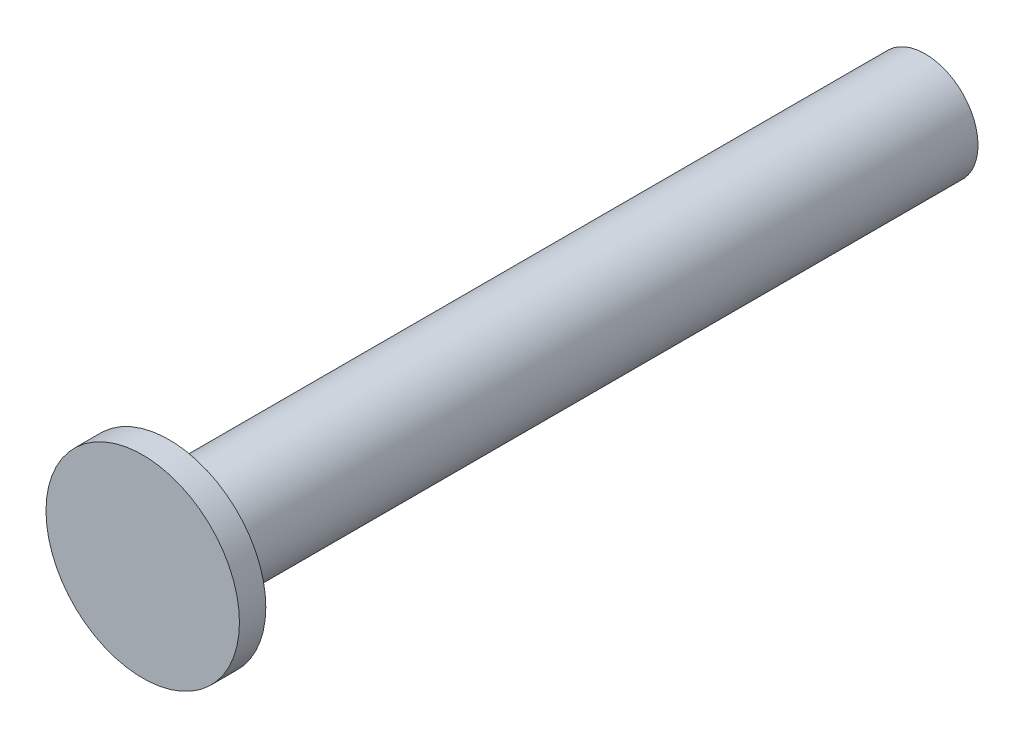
ISO-10303-21;
HEADER;
FILE_DESCRIPTION(('STEP AP214'),'2;1');
FILE_NAME('part.step','',(''),(''),'','','');
FILE_SCHEMA(('AUTOMOTIVE_DESIGN { 1 0 10303 214 1 1 1 1 }'));
ENDSEC;
DATA;
#1=APPLICATION_CONTEXT('core data for automotive mechanical design processes');
#2=APPLICATION_PROTOCOL_DEFINITION('international standard','automotive_design',2000,#1);
#3=PRODUCT_CONTEXT('',#1,'mechanical');
#4=PRODUCT('Part','Part','',(#3));
#5=PRODUCT_RELATED_PRODUCT_CATEGORY('part','',(#4));
#6=PRODUCT_DEFINITION_FORMATION('','',#4);
#7=PRODUCT_DEFINITION_CONTEXT('part definition',#1,'design');
#8=PRODUCT_DEFINITION('design','',#6,#7);
#9=PRODUCT_DEFINITION_SHAPE('','',#8);
#10=(LENGTH_UNIT() NAMED_UNIT(*) SI_UNIT(.MILLI.,.METRE.));
#11=(NAMED_UNIT(*) PLANE_ANGLE_UNIT() SI_UNIT($,.RADIAN.));
#12=(NAMED_UNIT(*) SI_UNIT($,.STERADIAN.) SOLID_ANGLE_UNIT());
#13=UNCERTAINTY_MEASURE_WITH_UNIT(LENGTH_MEASURE(1.E-05),#10,'distance_accuracy_value','');
#14=(GEOMETRIC_REPRESENTATION_CONTEXT(3) GLOBAL_UNCERTAINTY_ASSIGNED_CONTEXT((#13)) GLOBAL_UNIT_ASSIGNED_CONTEXT((#10,
#11,#12)) REPRESENTATION_CONTEXT('',''));
#15=CARTESIAN_POINT('',(0.,0.,0.));
#16=DIRECTION('',(0.,0.,1.));
#17=DIRECTION('',(1.,0.,0.));
#18=AXIS2_PLACEMENT_3D('',#15,#16,#17);
#19=CARTESIAN_POINT('',(0.,0.,43.));
#20=DIRECTION('',(0.,0.,-1.));
#21=DIRECTION('',(-1.,0.,0.));
#22=AXIS2_PLACEMENT_3D('',#19,#20,#21);
#23=CYLINDRICAL_SURFACE('',#22,3.);
#24=CARTESIAN_POINT('',(0.,0.,43.));
#25=DIRECTION('',(0.,0.,1.));
#26=DIRECTION('',(1.,0.,0.));
#27=AXIS2_PLACEMENT_3D('',#24,#25,#26);
#28=CIRCLE('',#27,3.);
#29=CARTESIAN_POINT('',(3.,0.,43.));
#30=VERTEX_POINT('',#29);
#31=EDGE_CURVE('E10',#30,#30,#28,.T.);
#32=ORIENTED_EDGE('',*,*,#31,.F.);
#33=EDGE_LOOP('',(#32));
#34=FACE_BOUND('',#33,.T.);
#35=CARTESIAN_POINT('',(0.,0.,0.));
#36=DIRECTION('',(0.,0.,1.));
#37=DIRECTION('',(1.,0.,0.));
#38=AXIS2_PLACEMENT_3D('',#35,#36,#37);
#39=CIRCLE('',#38,3.);
#40=CARTESIAN_POINT('',(3.,0.,0.));
#41=VERTEX_POINT('',#40);
#42=EDGE_CURVE('E33',#41,#41,#39,.T.);
#43=ORIENTED_EDGE('',*,*,#42,.T.);
#44=EDGE_LOOP('',(#43));
#45=FACE_BOUND('',#44,.T.);
#46=ADVANCED_FACE('F30',(#34,#45),#23,.T.);
#47=CARTESIAN_POINT('',(0.,0.,0.));
#48=DIRECTION('',(0.,0.,1.));
#49=DIRECTION('',(1.,0.,0.));
#50=AXIS2_PLACEMENT_3D('',#47,#48,#49);
#51=PLANE('',#50);
#52=ORIENTED_EDGE('',*,*,#42,.F.);
#53=EDGE_LOOP('',(#52));
#54=FACE_BOUND('',#53,.T.);
#55=ADVANCED_FACE('F53',(#54),#51,.F.);
#56=CARTESIAN_POINT('',(0.,0.,44.5));
#57=DIRECTION('',(0.,0.,-1.));
#58=DIRECTION('',(-1.,0.,0.));
#59=AXIS2_PLACEMENT_3D('',#56,#57,#58);
#60=CYLINDRICAL_SURFACE('',#59,5.5);
#61=CARTESIAN_POINT('',(0.,0.,44.5));
#62=DIRECTION('',(0.,0.,1.));
#63=DIRECTION('',(1.,0.,0.));
#64=AXIS2_PLACEMENT_3D('',#61,#62,#63);
#65=CIRCLE('',#64,5.5);
#66=CARTESIAN_POINT('',(5.5,0.,44.5));
#67=VERTEX_POINT('',#66);
#68=EDGE_CURVE('E40',#67,#67,#65,.T.);
#69=ORIENTED_EDGE('',*,*,#68,.F.);
#70=EDGE_LOOP('',(#69));
#71=FACE_BOUND('',#70,.T.);
#72=CARTESIAN_POINT('',(0.,0.,43.));
#73=DIRECTION('',(0.,0.,1.));
#74=DIRECTION('',(1.,0.,0.));
#75=AXIS2_PLACEMENT_3D('',#72,#73,#74);
#76=CIRCLE('',#75,5.5);
#77=CARTESIAN_POINT('',(5.5,0.,43.));
#78=VERTEX_POINT('',#77);
#79=EDGE_CURVE('E42',#78,#78,#76,.T.);
#80=ORIENTED_EDGE('',*,*,#79,.T.);
#81=EDGE_LOOP('',(#80));
#82=FACE_BOUND('',#81,.T.);
#83=ADVANCED_FACE('F50',(#71,#82),#60,.T.);
#84=CARTESIAN_POINT('',(0.,0.,44.5));
#85=DIRECTION('',(0.,0.,1.));
#86=DIRECTION('',(1.,0.,0.));
#87=AXIS2_PLACEMENT_3D('',#84,#85,#86);
#88=PLANE('',#87);
#89=ORIENTED_EDGE('',*,*,#68,.T.);
#90=EDGE_LOOP('',(#89));
#91=FACE_BOUND('',#90,.T.);
#92=ADVANCED_FACE('F48',(#91),#88,.T.);
#93=CARTESIAN_POINT('',(0.,0.,43.));
#94=DIRECTION('',(0.,0.,1.));
#95=DIRECTION('',(1.,0.,0.));
#96=AXIS2_PLACEMENT_3D('',#93,#94,#95);
#97=PLANE('',#96);
#98=ORIENTED_EDGE('',*,*,#31,.T.);
#99=EDGE_LOOP('',(#98));
#100=FACE_BOUND('',#99,.T.);
#101=ORIENTED_EDGE('',*,*,#79,.F.);
#102=EDGE_LOOP('',(#101));
#103=FACE_BOUND('',#102,.T.);
#104=ADVANCED_FACE('F57',(#100,#103),#97,.F.);
#105=CLOSED_SHELL('',(#46,#55,#83,#92,#104));
#106=MANIFOLD_SOLID_BREP('B2',#105);
#107=ADVANCED_BREP_SHAPE_REPRESENTATION('',(#18,#106),#14);
#108=SHAPE_DEFINITION_REPRESENTATION(#9,#107);
ENDSEC;
END-ISO-10303-21;
